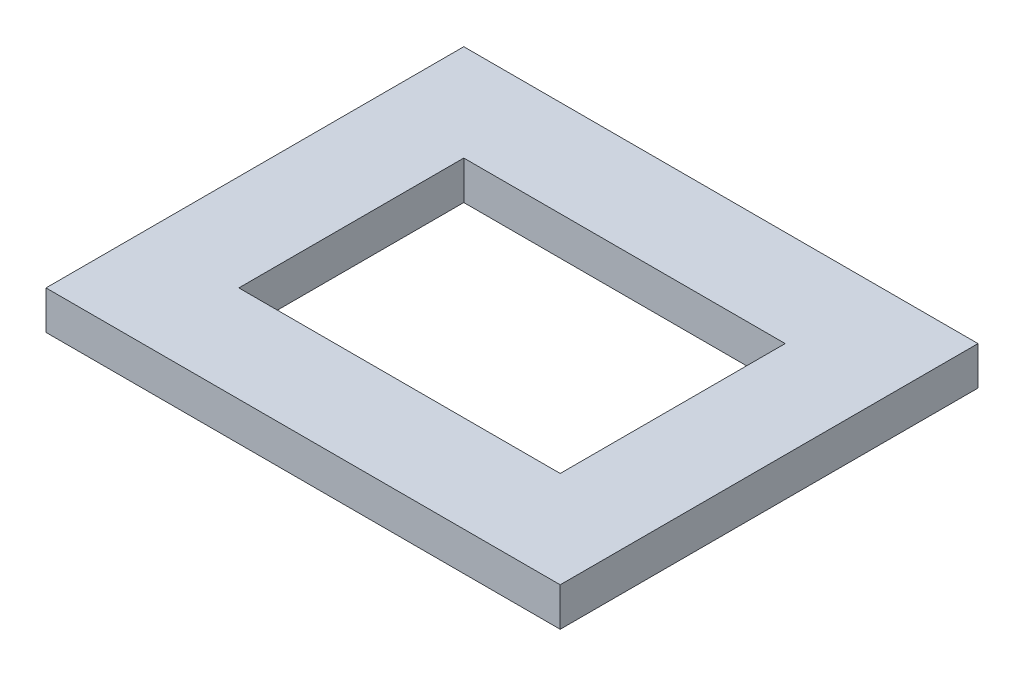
from build123d import *

# Parameters (mm, degrees)
SKETCH1_W           = 203.2
SKETCH1_H           = 165.1
SKETCH1_W_2         = 127
SKETCH1_H_2         = 88.9
BOSS_EXTRUDE1_DEPTH = 7.62


with BuildPart() as part:
    # Sketch1 → Boss-Extrude1 (new, symmetric)
    with BuildSketch(Plane(origin=(0, 0, 0), x_dir=(1, 0, 0), z_dir=(0, 1, 0))):
        Rectangle(SKETCH1_W, SKETCH1_H)
        Rectangle(SKETCH1_W_2, SKETCH1_H_2, mode=Mode.SUBTRACT)
    extrude(amount=BOSS_EXTRUDE1_DEPTH, both=True)


solid = part.part
